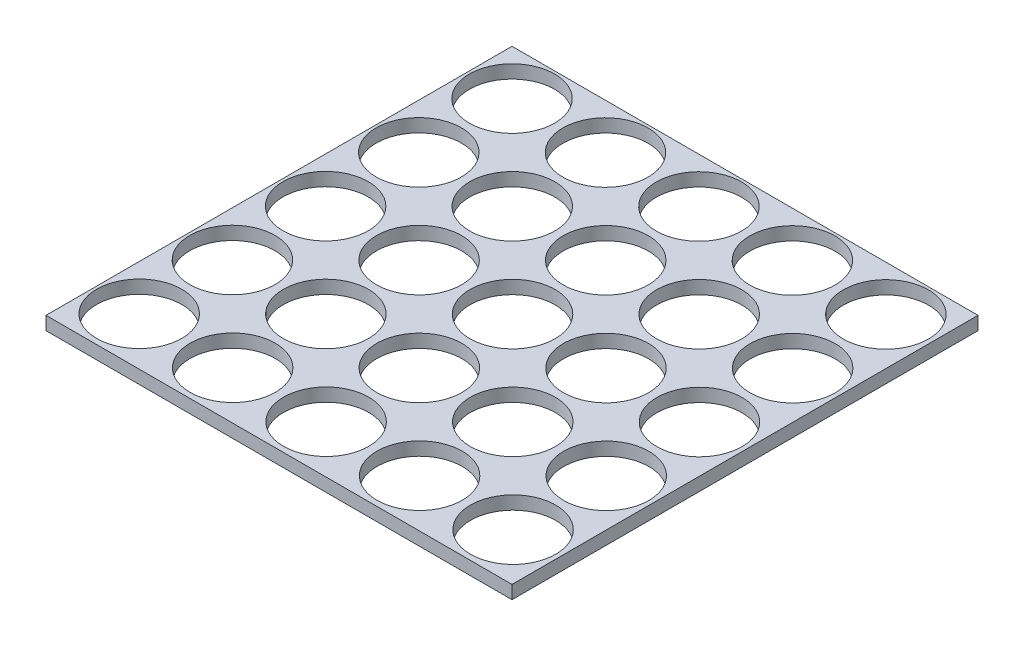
from build123d import *

# Parameters (mm, degrees)
SKETCH1_W                  = 175.5
SKETCH1_H                  = 175.5
BOSS_EXTRUDE1_DEPTH        = 5
SKETCH2_R                  = 16.05
CUT_EXTRUDE2_DEPTH         = 5
LPATTERN1_COUNT            = 5
LPATTERN1_PITCH            = 35.2
LPATTERN2_COUNT            = 5
LPATTERN2_PITCH            = 35.1
LPATTERN2_COPY_1_SKETCH_R  = 16.05
LPATTERN2_COPY_1_DEPTH     = 5
LPATTERN2_COPY_2_SKETCH_R  = 16.05
LPATTERN2_COPY_2_DEPTH     = 5
LPATTERN2_COPY_3_SKETCH_R  = 16.05
LPATTERN2_COPY_3_DEPTH     = 5
LPATTERN2_COPY_4_SKETCH_R  = 16.05
LPATTERN2_COPY_4_DEPTH     = 5
LPATTERN2_COPY_5_SKETCH_R  = 16.05
LPATTERN2_COPY_5_DEPTH     = 5
LPATTERN2_COPY_6_SKETCH_R  = 16.05
LPATTERN2_COPY_6_DEPTH     = 5
LPATTERN2_COPY_7_SKETCH_R  = 16.05
LPATTERN2_COPY_7_DEPTH     = 5
LPATTERN2_COPY_8_SKETCH_R  = 16.05
LPATTERN2_COPY_8_DEPTH     = 5
LPATTERN2_COPY_9_SKETCH_R  = 16.05
LPATTERN2_COPY_9_DEPTH     = 5
LPATTERN2_COPY_10_SKETCH_R = 16.05
LPATTERN2_COPY_10_DEPTH    = 5
LPATTERN2_COPY_11_SKETCH_R = 16.05
LPATTERN2_COPY_11_DEPTH    = 5
LPATTERN2_COPY_12_SKETCH_R = 16.05
LPATTERN2_COPY_12_DEPTH    = 5
LPATTERN2_COPY_13_SKETCH_R = 16.05
LPATTERN2_COPY_13_DEPTH    = 5
LPATTERN2_COPY_14_SKETCH_R = 16.05
LPATTERN2_COPY_14_DEPTH    = 5
LPATTERN2_COPY_15_SKETCH_R = 16.05
LPATTERN2_COPY_15_DEPTH    = 5
LPATTERN2_COPY_16_SKETCH_R = 16.05
LPATTERN2_COPY_16_DEPTH    = 5


with BuildPart() as part:
    # Sketch1 → Boss-Extrude1 (new body)
    with BuildSketch(Plane(origin=(0, 0, 0), x_dir=(1, 0, 0), z_dir=(0, 1, 0))):
        Rectangle(SKETCH1_W, SKETCH1_H)
    extrude(amount=BOSS_EXTRUDE1_DEPTH)

    # Sketch2 → Cut-Extrude2 (cut)
    with BuildSketch(Plane(origin=(0, 5, 0), x_dir=(1, 0, 0), z_dir=(0, 1, 0))):
        with Locations(Location((-70.7, 70.7, 0), (0, 0, 270))):
            Circle(SKETCH2_R)
    cut_extrude2 = extrude(amount=-CUT_EXTRUDE2_DEPTH, mode=Mode.SUBTRACT)

    # LPattern1: Cut-Extrude2 ×5
    with Locations(*[(i * LPATTERN1_PITCH, 0, 0) for i in range(1, LPATTERN1_COUNT)]):
        add(cut_extrude2, mode=Mode.SUBTRACT)

    # LPattern2: Cut-Extrude2 ×5
    with Locations(*[(0, 0, i * LPATTERN2_PITCH) for i in range(1, LPATTERN2_COUNT)]):
        add(cut_extrude2, mode=Mode.SUBTRACT)

    # LPattern2 copy 1 sketch → LPattern2 copy 1 (cut)
    with BuildSketch(Plane(origin=(35.2, 5, 35.1), x_dir=(1, 0, 0), z_dir=(0, 1, 0))):
        with Locations(Location((-70.7, 70.7, 0), (0, 0, 270))):
            Circle(LPATTERN2_COPY_1_SKETCH_R)
    extrude(amount=-LPATTERN2_COPY_1_DEPTH, mode=Mode.SUBTRACT)

    # LPattern2 copy 2 sketch → LPattern2 copy 2 (cut)
    with BuildSketch(Plane(origin=(35.2, 5, 70.2), x_dir=(1, 0, 0), z_dir=(0, 1, 0))):
        with Locations(Location((-70.7, 70.7, 0), (0, 0, 270))):
            Circle(LPATTERN2_COPY_2_SKETCH_R)
    extrude(amount=-LPATTERN2_COPY_2_DEPTH, mode=Mode.SUBTRACT)

    # LPattern2 copy 3 sketch → LPattern2 copy 3 (cut)
    with BuildSketch(Plane(origin=(35.2, 5, 105.3), x_dir=(1, 0, 0), z_dir=(0, 1, 0))):
        with Locations(Location((-70.7, 70.7, 0), (0, 0, 270))):
            Circle(LPATTERN2_COPY_3_SKETCH_R)
    extrude(amount=-LPATTERN2_COPY_3_DEPTH, mode=Mode.SUBTRACT)

    # LPattern2 copy 4 sketch → LPattern2 copy 4 (cut)
    with BuildSketch(Plane(origin=(35.2, 5, 140.4), x_dir=(1, 0, 0), z_dir=(0, 1, 0))):
        with Locations(Location((-70.7, 70.7, 0), (0, 0, 270))):
            Circle(LPATTERN2_COPY_4_SKETCH_R)
    extrude(amount=-LPATTERN2_COPY_4_DEPTH, mode=Mode.SUBTRACT)

    # LPattern2 copy 5 sketch → LPattern2 copy 5 (cut)
    with BuildSketch(Plane(origin=(70.4, 5, 35.1), x_dir=(1, 0, 0), z_dir=(0, 1, 0))):
        with Locations(Location((-70.7, 70.7, 0), (0, 0, 270))):
            Circle(LPATTERN2_COPY_5_SKETCH_R)
    extrude(amount=-LPATTERN2_COPY_5_DEPTH, mode=Mode.SUBTRACT)

    # LPattern2 copy 6 sketch → LPattern2 copy 6 (cut)
    with BuildSketch(Plane(origin=(70.4, 5, 70.2), x_dir=(1, 0, 0), z_dir=(0, 1, 0))):
        with Locations(Location((-70.7, 70.7, 0), (0, 0, 270))):
            Circle(LPATTERN2_COPY_6_SKETCH_R)
    extrude(amount=-LPATTERN2_COPY_6_DEPTH, mode=Mode.SUBTRACT)

    # LPattern2 copy 7 sketch → LPattern2 copy 7 (cut)
    with BuildSketch(Plane(origin=(70.4, 5, 105.3), x_dir=(1, 0, 0), z_dir=(0, 1, 0))):
        with Locations(Location((-70.7, 70.7, 0), (0, 0, 270))):
            Circle(LPATTERN2_COPY_7_SKETCH_R)
    extrude(amount=-LPATTERN2_COPY_7_DEPTH, mode=Mode.SUBTRACT)

    # LPattern2 copy 8 sketch → LPattern2 copy 8 (cut)
    with BuildSketch(Plane(origin=(70.4, 5, 140.4), x_dir=(1, 0, 0), z_dir=(0, 1, 0))):
        with Locations(Location((-70.7, 70.7, 0), (0, 0, 270))):
            Circle(LPATTERN2_COPY_8_SKETCH_R)
    extrude(amount=-LPATTERN2_COPY_8_DEPTH, mode=Mode.SUBTRACT)

    # LPattern2 copy 9 sketch → LPattern2 copy 9 (cut)
    with BuildSketch(Plane(origin=(105.6, 5, 35.1), x_dir=(1, 0, 0), z_dir=(0, 1, 0))):
        with Locations(Location((-70.7, 70.7, 0), (0, 0, 270))):
            Circle(LPATTERN2_COPY_9_SKETCH_R)
    extrude(amount=-LPATTERN2_COPY_9_DEPTH, mode=Mode.SUBTRACT)

    # LPattern2 copy 10 sketch → LPattern2 copy 10 (cut)
    with BuildSketch(Plane(origin=(105.6, 5, 70.2), x_dir=(1, 0, 0), z_dir=(0, 1, 0))):
        with Locations(Location((-70.7, 70.7, 0), (0, 0, 270))):
            Circle(LPATTERN2_COPY_10_SKETCH_R)
    extrude(amount=-LPATTERN2_COPY_10_DEPTH, mode=Mode.SUBTRACT)

    # LPattern2 copy 11 sketch → LPattern2 copy 11 (cut)
    with BuildSketch(Plane(origin=(105.6, 5, 105.3), x_dir=(1, 0, 0), z_dir=(0, 1, 0))):
        with Locations(Location((-70.7, 70.7, 0), (0, 0, 270))):
            Circle(LPATTERN2_COPY_11_SKETCH_R)
    extrude(amount=-LPATTERN2_COPY_11_DEPTH, mode=Mode.SUBTRACT)

    # LPattern2 copy 12 sketch → LPattern2 copy 12 (cut)
    with BuildSketch(Plane(origin=(105.6, 5, 140.4), x_dir=(1, 0, 0), z_dir=(0, 1, 0))):
        with Locations(Location((-70.7, 70.7, 0), (0, 0, 270))):
            Circle(LPATTERN2_COPY_12_SKETCH_R)
    extrude(amount=-LPATTERN2_COPY_12_DEPTH, mode=Mode.SUBTRACT)

    # LPattern2 copy 13 sketch → LPattern2 copy 13 (cut)
    with BuildSketch(Plane(origin=(140.8, 5, 35.1), x_dir=(1, 0, 0), z_dir=(0, 1, 0))):
        with Locations(Location((-70.7, 70.7, 0), (0, 0, 270))):
            Circle(LPATTERN2_COPY_13_SKETCH_R)
    extrude(amount=-LPATTERN2_COPY_13_DEPTH, mode=Mode.SUBTRACT)

    # LPattern2 copy 14 sketch → LPattern2 copy 14 (cut)
    with BuildSketch(Plane(origin=(140.8, 5, 70.2), x_dir=(1, 0, 0), z_dir=(0, 1, 0))):
        with Locations(Location((-70.7, 70.7, 0), (0, 0, 270))):
            Circle(LPATTERN2_COPY_14_SKETCH_R)
    extrude(amount=-LPATTERN2_COPY_14_DEPTH, mode=Mode.SUBTRACT)

    # LPattern2 copy 15 sketch → LPattern2 copy 15 (cut)
    with BuildSketch(Plane(origin=(140.8, 5, 105.3), x_dir=(1, 0, 0), z_dir=(0, 1, 0))):
        with Locations(Location((-70.7, 70.7, 0), (0, 0, 270))):
            Circle(LPATTERN2_COPY_15_SKETCH_R)
    extrude(amount=-LPATTERN2_COPY_15_DEPTH, mode=Mode.SUBTRACT)

    # LPattern2 copy 16 sketch → LPattern2 copy 16 (cut)
    with BuildSketch(Plane(origin=(140.8, 5, 140.4), x_dir=(1, 0, 0), z_dir=(0, 1, 0))):
        with Locations(Location((-70.7, 70.7, 0), (0, 0, 270))):
            Circle(LPATTERN2_COPY_16_SKETCH_R)
    extrude(amount=-LPATTERN2_COPY_16_DEPTH, mode=Mode.SUBTRACT)


solid = part.part
